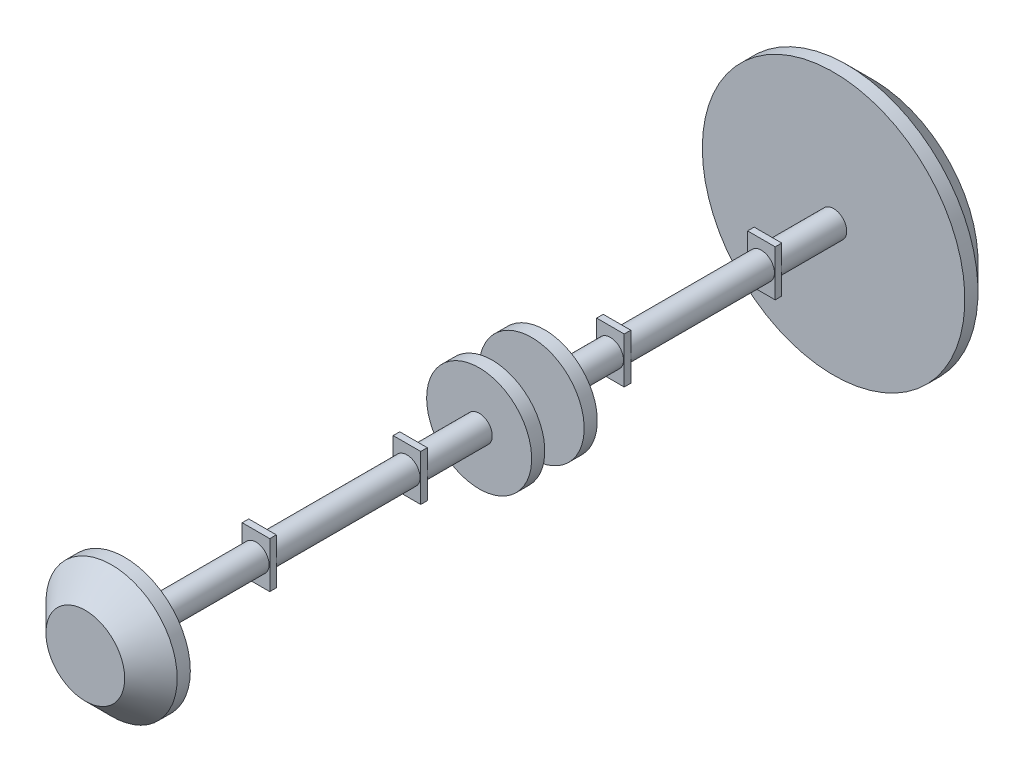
ISO-10303-21;
HEADER;
FILE_DESCRIPTION(('STEP AP214'),'2;1');
FILE_NAME('part.step','',(''),(''),'','','');
FILE_SCHEMA(('AUTOMOTIVE_DESIGN { 1 0 10303 214 1 1 1 1 }'));
ENDSEC;
DATA;
#1=APPLICATION_CONTEXT('core data for automotive mechanical design processes');
#2=APPLICATION_PROTOCOL_DEFINITION('international standard','automotive_design',2000,#1);
#3=PRODUCT_CONTEXT('',#1,'mechanical');
#4=PRODUCT('Part','Part','',(#3));
#5=PRODUCT_RELATED_PRODUCT_CATEGORY('part','',(#4));
#6=PRODUCT_DEFINITION_FORMATION('','',#4);
#7=PRODUCT_DEFINITION_CONTEXT('part definition',#1,'design');
#8=PRODUCT_DEFINITION('design','',#6,#7);
#9=PRODUCT_DEFINITION_SHAPE('','',#8);
#10=(LENGTH_UNIT() NAMED_UNIT(*) SI_UNIT(.MILLI.,.METRE.));
#11=(NAMED_UNIT(*) PLANE_ANGLE_UNIT() SI_UNIT($,.RADIAN.));
#12=(NAMED_UNIT(*) SI_UNIT($,.STERADIAN.) SOLID_ANGLE_UNIT());
#13=UNCERTAINTY_MEASURE_WITH_UNIT(LENGTH_MEASURE(1.E-05),#10,'distance_accuracy_value','');
#14=(GEOMETRIC_REPRESENTATION_CONTEXT(3) GLOBAL_UNCERTAINTY_ASSIGNED_CONTEXT((#13)) GLOBAL_UNIT_ASSIGNED_CONTEXT((#10,
#11,#12)) REPRESENTATION_CONTEXT('',''));
#15=CARTESIAN_POINT('',(0.,0.,0.));
#16=DIRECTION('',(0.,0.,1.));
#17=DIRECTION('',(1.,0.,0.));
#18=AXIS2_PLACEMENT_3D('',#15,#16,#17);
#19=CARTESIAN_POINT('',(0.,0.,-180.));
#20=DIRECTION('',(0.,0.,-1.));
#21=DIRECTION('',(-1.,0.,0.));
#22=AXIS2_PLACEMENT_3D('',#19,#20,#21);
#23=PLANE('',#22);
#24=CARTESIAN_POINT('',(0.,0.,-180.));
#25=DIRECTION('',(0.,0.,-1.));
#26=DIRECTION('',(-1.,0.,0.));
#27=AXIS2_PLACEMENT_3D('',#24,#25,#26);
#28=CIRCLE('',#27,40.);
#29=CARTESIAN_POINT('',(-40.,0.,-180.));
#30=VERTEX_POINT('',#29);
#31=EDGE_CURVE('E136',#30,#30,#28,.T.);
#32=ORIENTED_EDGE('',*,*,#31,.T.);
#33=EDGE_LOOP('',(#32));
#34=FACE_BOUND('',#33,.T.);
#35=ADVANCED_FACE('F42',(#34),#23,.T.);
#36=CARTESIAN_POINT('',(10.5,17.5,-120.));
#37=DIRECTION('',(0.,0.,-1.));
#38=DIRECTION('',(-1.,0.,0.));
#39=AXIS2_PLACEMENT_3D('',#36,#37,#38);
#40=PLANE('',#39);
#41=DIRECTION('',(1.,0.,0.));
#42=VECTOR('',#41,1.);
#43=CARTESIAN_POINT('',(-10.5,17.5,-120.));
#44=LINE('',#43,#42);
#45=CARTESIAN_POINT('',(-10.5,17.5,-120.));
#46=VERTEX_POINT('',#45);
#47=CARTESIAN_POINT('',(10.5,17.5,-120.));
#48=VERTEX_POINT('',#47);
#49=EDGE_CURVE('E118',#46,#48,#44,.T.);
#50=ORIENTED_EDGE('',*,*,#49,.T.);
#51=DIRECTION('',(0.,-1.,0.));
#52=VECTOR('',#51,1.);
#53=CARTESIAN_POINT('',(10.5,17.5,-120.));
#54=LINE('',#53,#52);
#55=CARTESIAN_POINT('',(10.5,-17.5,-120.));
#56=VERTEX_POINT('',#55);
#57=EDGE_CURVE('E111',#48,#56,#54,.T.);
#58=ORIENTED_EDGE('',*,*,#57,.T.);
#59=DIRECTION('',(-1.,0.,0.));
#60=VECTOR('',#59,1.);
#61=CARTESIAN_POINT('',(10.5,-17.5,-120.));
#62=LINE('',#61,#60);
#63=CARTESIAN_POINT('',(-10.5,-17.5,-120.));
#64=VERTEX_POINT('',#63);
#65=EDGE_CURVE('E115',#56,#64,#62,.T.);
#66=ORIENTED_EDGE('',*,*,#65,.T.);
#67=DIRECTION('',(0.,1.,0.));
#68=VECTOR('',#67,1.);
#69=CARTESIAN_POINT('',(-10.5,-17.5,-120.));
#70=LINE('',#69,#68);
#71=EDGE_CURVE('E129',#64,#46,#70,.T.);
#72=ORIENTED_EDGE('',*,*,#71,.T.);
#73=EDGE_LOOP('',(#50,#58,#66,#72));
#74=FACE_BOUND('',#73,.T.);
#75=CARTESIAN_POINT('',(0.,0.,-120.));
#76=DIRECTION('',(0.,0.,-1.));
#77=DIRECTION('',(-1.,0.,0.));
#78=AXIS2_PLACEMENT_3D('',#75,#76,#77);
#79=CIRCLE('',#78,10.);
#80=CARTESIAN_POINT('',(-10.,0.,-120.));
#81=VERTEX_POINT('',#80);
#82=EDGE_CURVE('E149',#81,#81,#79,.T.);
#83=ORIENTED_EDGE('',*,*,#82,.F.);
#84=EDGE_LOOP('',(#83));
#85=FACE_BOUND('',#84,.T.);
#86=ADVANCED_FACE('F112',(#74,#85),#40,.T.);
#87=CARTESIAN_POINT('',(10.5,-17.5,-5.));
#88=DIRECTION('',(0.,0.,-1.));
#89=DIRECTION('',(-1.,0.,0.));
#90=AXIS2_PLACEMENT_3D('',#87,#88,#89);
#91=PLANE('',#90);
#92=DIRECTION('',(0.,-1.,0.));
#93=VECTOR('',#92,1.);
#94=CARTESIAN_POINT('',(10.5,17.5,-5.));
#95=LINE('',#94,#93);
#96=CARTESIAN_POINT('',(10.5,17.5,-5.));
#97=VERTEX_POINT('',#96);
#98=CARTESIAN_POINT('',(10.5,-17.5,-5.));
#99=VERTEX_POINT('',#98);
#100=EDGE_CURVE('E131',#97,#99,#95,.T.);
#101=ORIENTED_EDGE('',*,*,#100,.T.);
#102=DIRECTION('',(-1.,0.,0.));
#103=VECTOR('',#102,1.);
#104=CARTESIAN_POINT('',(10.5,-17.5,-5.));
#105=LINE('',#104,#103);
#106=CARTESIAN_POINT('',(-10.5,-17.5,-5.));
#107=VERTEX_POINT('',#106);
#108=EDGE_CURVE('E244',#99,#107,#105,.T.);
#109=ORIENTED_EDGE('',*,*,#108,.T.);
#110=DIRECTION('',(0.,1.,0.));
#111=VECTOR('',#110,1.);
#112=CARTESIAN_POINT('',(-10.5,17.5,-5.));
#113=LINE('',#112,#111);
#114=CARTESIAN_POINT('',(-10.5,17.5,-5.));
#115=VERTEX_POINT('',#114);
#116=EDGE_CURVE('E241',#107,#115,#113,.T.);
#117=ORIENTED_EDGE('',*,*,#116,.T.);
#118=DIRECTION('',(1.,0.,0.));
#119=VECTOR('',#118,1.);
#120=CARTESIAN_POINT('',(10.5,17.5,-5.));
#121=LINE('',#120,#119);
#122=EDGE_CURVE('E225',#115,#97,#121,.T.);
#123=ORIENTED_EDGE('',*,*,#122,.T.);
#124=EDGE_LOOP('',(#101,#109,#117,#123));
#125=FACE_BOUND('',#124,.T.);
#126=CARTESIAN_POINT('',(0.,0.,-5.));
#127=DIRECTION('',(0.,0.,-1.));
#128=DIRECTION('',(-1.,0.,0.));
#129=AXIS2_PLACEMENT_3D('',#126,#127,#128);
#130=CIRCLE('',#129,10.);
#131=CARTESIAN_POINT('',(-10.,0.,-5.));
#132=VERTEX_POINT('',#131);
#133=EDGE_CURVE('E236',#132,#132,#130,.T.);
#134=ORIENTED_EDGE('',*,*,#133,.F.);
#135=EDGE_LOOP('',(#134));
#136=FACE_BOUND('',#135,.T.);
#137=ADVANCED_FACE('F179',(#125,#136),#91,.T.);
#138=CARTESIAN_POINT('',(0.,0.,100.));
#139=DIRECTION('',(0.,0.,-1.));
#140=DIRECTION('',(-1.,0.,0.));
#141=AXIS2_PLACEMENT_3D('',#138,#139,#140);
#142=CYLINDRICAL_SURFACE('',#141,10.);
#143=CARTESIAN_POINT('',(0.,0.,100.));
#144=DIRECTION('',(0.,0.,1.));
#145=DIRECTION('',(1.,0.,0.));
#146=AXIS2_PLACEMENT_3D('',#143,#144,#145);
#147=CIRCLE('',#146,10.);
#148=CARTESIAN_POINT('',(10.,0.,100.));
#149=VERTEX_POINT('',#148);
#150=EDGE_CURVE('E152',#149,#149,#147,.T.);
#151=ORIENTED_EDGE('',*,*,#150,.F.);
#152=EDGE_LOOP('',(#151));
#153=FACE_BOUND('',#152,.T.);
#154=CARTESIAN_POINT('',(0.,0.,0.));
#155=DIRECTION('',(0.,0.,-1.));
#156=DIRECTION('',(-1.,0.,0.));
#157=AXIS2_PLACEMENT_3D('',#154,#155,#156);
#158=CIRCLE('',#157,10.);
#159=CARTESIAN_POINT('',(-10.,0.,0.));
#160=VERTEX_POINT('',#159);
#161=EDGE_CURVE('E221',#160,#160,#158,.T.);
#162=ORIENTED_EDGE('',*,*,#161,.F.);
#163=EDGE_LOOP('',(#162));
#164=FACE_BOUND('',#163,.T.);
#165=ADVANCED_FACE('F185',(#153,#164),#142,.T.);
#166=CARTESIAN_POINT('',(10.5,-17.5,0.));
#167=DIRECTION('',(0.,0.,-1.));
#168=DIRECTION('',(-1.,0.,0.));
#169=AXIS2_PLACEMENT_3D('',#166,#167,#168);
#170=PLANE('',#169);
#171=DIRECTION('',(0.,-1.,0.));
#172=VECTOR('',#171,1.);
#173=CARTESIAN_POINT('',(10.5,17.5,0.));
#174=LINE('',#173,#172);
#175=CARTESIAN_POINT('',(10.5,17.5,0.));
#176=VERTEX_POINT('',#175);
#177=CARTESIAN_POINT('',(10.5,-17.5,0.));
#178=VERTEX_POINT('',#177);
#179=EDGE_CURVE('E224',#176,#178,#174,.T.);
#180=ORIENTED_EDGE('',*,*,#179,.F.);
#181=DIRECTION('',(1.,0.,0.));
#182=VECTOR('',#181,1.);
#183=CARTESIAN_POINT('',(10.5,17.5,0.));
#184=LINE('',#183,#182);
#185=CARTESIAN_POINT('',(-10.5,17.5,0.));
#186=VERTEX_POINT('',#185);
#187=EDGE_CURVE('E86',#186,#176,#184,.T.);
#188=ORIENTED_EDGE('',*,*,#187,.F.);
#189=DIRECTION('',(0.,1.,0.));
#190=VECTOR('',#189,1.);
#191=CARTESIAN_POINT('',(-10.5,17.5,0.));
#192=LINE('',#191,#190);
#193=CARTESIAN_POINT('',(-10.5,-17.5,0.));
#194=VERTEX_POINT('',#193);
#195=EDGE_CURVE('E229',#194,#186,#192,.T.);
#196=ORIENTED_EDGE('',*,*,#195,.F.);
#197=DIRECTION('',(-1.,0.,0.));
#198=VECTOR('',#197,1.);
#199=CARTESIAN_POINT('',(10.5,-17.5,0.));
#200=LINE('',#199,#198);
#201=EDGE_CURVE('E230',#178,#194,#200,.T.);
#202=ORIENTED_EDGE('',*,*,#201,.F.);
#203=EDGE_LOOP('',(#180,#188,#196,#202));
#204=FACE_BOUND('',#203,.T.);
#205=ORIENTED_EDGE('',*,*,#161,.T.);
#206=EDGE_LOOP('',(#205));
#207=FACE_BOUND('',#206,.T.);
#208=ADVANCED_FACE('F276',(#204,#207),#170,.F.);
#209=CARTESIAN_POINT('',(10.5,17.5,-5.));
#210=DIRECTION('',(-1.,0.,0.));
#211=DIRECTION('',(0.,-1.,0.));
#212=AXIS2_PLACEMENT_3D('',#209,#210,#211);
#213=PLANE('',#212);
#214=ORIENTED_EDGE('',*,*,#179,.T.);
#215=DIRECTION('',(0.,0.,1.));
#216=VECTOR('',#215,1.);
#217=CARTESIAN_POINT('',(10.5,-17.5,-5.));
#218=LINE('',#217,#216);
#219=EDGE_CURVE('E226',#99,#178,#218,.T.);
#220=ORIENTED_EDGE('',*,*,#219,.F.);
#221=ORIENTED_EDGE('',*,*,#100,.F.);
#222=DIRECTION('',(0.,0.,1.));
#223=VECTOR('',#222,1.);
#224=CARTESIAN_POINT('',(10.5,17.5,-5.));
#225=LINE('',#224,#223);
#226=EDGE_CURVE('E237',#97,#176,#225,.T.);
#227=ORIENTED_EDGE('',*,*,#226,.T.);
#228=EDGE_LOOP('',(#214,#220,#221,#227));
#229=FACE_BOUND('',#228,.T.);
#230=ADVANCED_FACE('F278',(#229),#213,.F.);
#231=CARTESIAN_POINT('',(10.5,-17.5,-5.));
#232=DIRECTION('',(0.,1.,0.));
#233=DIRECTION('',(-1.,0.,0.));
#234=AXIS2_PLACEMENT_3D('',#231,#232,#233);
#235=PLANE('',#234);
#236=ORIENTED_EDGE('',*,*,#201,.T.);
#237=DIRECTION('',(0.,0.,1.));
#238=VECTOR('',#237,1.);
#239=CARTESIAN_POINT('',(-10.5,-17.5,-5.));
#240=LINE('',#239,#238);
#241=EDGE_CURVE('E231',#107,#194,#240,.T.);
#242=ORIENTED_EDGE('',*,*,#241,.F.);
#243=ORIENTED_EDGE('',*,*,#108,.F.);
#244=ORIENTED_EDGE('',*,*,#219,.T.);
#245=EDGE_LOOP('',(#236,#242,#243,#244));
#246=FACE_BOUND('',#245,.T.);
#247=ADVANCED_FACE('F286',(#246),#235,.F.);
#248=CARTESIAN_POINT('',(-10.5,17.5,-5.));
#249=DIRECTION('',(1.,0.,0.));
#250=DIRECTION('',(0.,1.,0.));
#251=AXIS2_PLACEMENT_3D('',#248,#249,#250);
#252=PLANE('',#251);
#253=ORIENTED_EDGE('',*,*,#195,.T.);
#254=DIRECTION('',(0.,0.,1.));
#255=VECTOR('',#254,1.);
#256=CARTESIAN_POINT('',(-10.5,17.5,-5.));
#257=LINE('',#256,#255);
#258=EDGE_CURVE('E234',#115,#186,#257,.T.);
#259=ORIENTED_EDGE('',*,*,#258,.F.);
#260=ORIENTED_EDGE('',*,*,#116,.F.);
#261=ORIENTED_EDGE('',*,*,#241,.T.);
#262=EDGE_LOOP('',(#253,#259,#260,#261));
#263=FACE_BOUND('',#262,.T.);
#264=ADVANCED_FACE('F283',(#263),#252,.F.);
#265=CARTESIAN_POINT('',(10.5,17.5,-5.));
#266=DIRECTION('',(0.,-1.,0.));
#267=DIRECTION('',(1.,0.,0.));
#268=AXIS2_PLACEMENT_3D('',#265,#266,#267);
#269=PLANE('',#268);
#270=ORIENTED_EDGE('',*,*,#187,.T.);
#271=ORIENTED_EDGE('',*,*,#226,.F.);
#272=ORIENTED_EDGE('',*,*,#122,.F.);
#273=ORIENTED_EDGE('',*,*,#258,.T.);
#274=EDGE_LOOP('',(#270,#271,#272,#273));
#275=FACE_BOUND('',#274,.T.);
#276=ADVANCED_FACE('F274',(#275),#269,.F.);
#277=CARTESIAN_POINT('',(0.,0.,-115.));
#278=DIRECTION('',(0.,0.,1.));
#279=DIRECTION('',(1.,0.,0.));
#280=AXIS2_PLACEMENT_3D('',#277,#278,#279);
#281=CYLINDRICAL_SURFACE('',#280,10.);
#282=CARTESIAN_POINT('',(0.,0.,-115.));
#283=DIRECTION('',(0.,0.,-1.));
#284=DIRECTION('',(-1.,0.,0.));
#285=AXIS2_PLACEMENT_3D('',#282,#283,#284);
#286=CIRCLE('',#285,10.);
#287=CARTESIAN_POINT('',(-10.,0.,-115.));
#288=VERTEX_POINT('',#287);
#289=EDGE_CURVE('E145',#288,#288,#286,.T.);
#290=ORIENTED_EDGE('',*,*,#289,.F.);
#291=EDGE_LOOP('',(#290));
#292=FACE_BOUND('',#291,.T.);
#293=ORIENTED_EDGE('',*,*,#133,.T.);
#294=EDGE_LOOP('',(#293));
#295=FACE_BOUND('',#294,.T.);
#296=ADVANCED_FACE('F194',(#292,#295),#281,.T.);
#297=CARTESIAN_POINT('',(10.5,17.5,-115.));
#298=DIRECTION('',(0.,0.,-1.));
#299=DIRECTION('',(-1.,0.,0.));
#300=AXIS2_PLACEMENT_3D('',#297,#298,#299);
#301=PLANE('',#300);
#302=DIRECTION('',(1.,0.,0.));
#303=VECTOR('',#302,1.);
#304=CARTESIAN_POINT('',(-10.5,17.5,-115.));
#305=LINE('',#304,#303);
#306=CARTESIAN_POINT('',(-10.5,17.5,-115.));
#307=VERTEX_POINT('',#306);
#308=CARTESIAN_POINT('',(10.5,17.5,-115.));
#309=VERTEX_POINT('',#308);
#310=EDGE_CURVE('E142',#307,#309,#305,.T.);
#311=ORIENTED_EDGE('',*,*,#310,.F.);
#312=DIRECTION('',(0.,1.,0.));
#313=VECTOR('',#312,1.);
#314=CARTESIAN_POINT('',(-10.5,-17.5,-115.));
#315=LINE('',#314,#313);
#316=CARTESIAN_POINT('',(-10.5,-17.5,-115.));
#317=VERTEX_POINT('',#316);
#318=EDGE_CURVE('E59',#317,#307,#315,.T.);
#319=ORIENTED_EDGE('',*,*,#318,.F.);
#320=DIRECTION('',(-1.,0.,0.));
#321=VECTOR('',#320,1.);
#322=CARTESIAN_POINT('',(10.5,-17.5,-115.));
#323=LINE('',#322,#321);
#324=CARTESIAN_POINT('',(10.5,-17.5,-115.));
#325=VERTEX_POINT('',#324);
#326=EDGE_CURVE('E124',#325,#317,#323,.T.);
#327=ORIENTED_EDGE('',*,*,#326,.F.);
#328=DIRECTION('',(0.,-1.,0.));
#329=VECTOR('',#328,1.);
#330=CARTESIAN_POINT('',(10.5,17.5,-115.));
#331=LINE('',#330,#329);
#332=EDGE_CURVE('E72',#309,#325,#331,.T.);
#333=ORIENTED_EDGE('',*,*,#332,.F.);
#334=EDGE_LOOP('',(#311,#319,#327,#333));
#335=FACE_BOUND('',#334,.T.);
#336=ORIENTED_EDGE('',*,*,#289,.T.);
#337=EDGE_LOOP('',(#336));
#338=FACE_BOUND('',#337,.T.);
#339=ADVANCED_FACE('F191',(#335,#338),#301,.F.);
#340=CARTESIAN_POINT('',(-10.5,17.5,-120.));
#341=DIRECTION('',(0.,-1.,0.));
#342=DIRECTION('',(1.,0.,0.));
#343=AXIS2_PLACEMENT_3D('',#340,#341,#342);
#344=PLANE('',#343);
#345=ORIENTED_EDGE('',*,*,#310,.T.);
#346=DIRECTION('',(0.,0.,1.));
#347=VECTOR('',#346,1.);
#348=CARTESIAN_POINT('',(10.5,17.5,-120.));
#349=LINE('',#348,#347);
#350=EDGE_CURVE('E139',#48,#309,#349,.T.);
#351=ORIENTED_EDGE('',*,*,#350,.F.);
#352=ORIENTED_EDGE('',*,*,#49,.F.);
#353=DIRECTION('',(0.,0.,1.));
#354=VECTOR('',#353,1.);
#355=CARTESIAN_POINT('',(-10.5,17.5,-120.));
#356=LINE('',#355,#354);
#357=EDGE_CURVE('E141',#46,#307,#356,.T.);
#358=ORIENTED_EDGE('',*,*,#357,.T.);
#359=EDGE_LOOP('',(#345,#351,#352,#358));
#360=FACE_BOUND('',#359,.T.);
#361=ADVANCED_FACE('F193',(#360),#344,.F.);
#362=CARTESIAN_POINT('',(10.5,17.5,-120.));
#363=DIRECTION('',(-1.,0.,0.));
#364=DIRECTION('',(0.,-1.,0.));
#365=AXIS2_PLACEMENT_3D('',#362,#363,#364);
#366=PLANE('',#365);
#367=ORIENTED_EDGE('',*,*,#332,.T.);
#368=DIRECTION('',(0.,0.,1.));
#369=VECTOR('',#368,1.);
#370=CARTESIAN_POINT('',(10.5,-17.5,-120.));
#371=LINE('',#370,#369);
#372=EDGE_CURVE('E121',#56,#325,#371,.T.);
#373=ORIENTED_EDGE('',*,*,#372,.F.);
#374=ORIENTED_EDGE('',*,*,#57,.F.);
#375=ORIENTED_EDGE('',*,*,#350,.T.);
#376=EDGE_LOOP('',(#367,#373,#374,#375));
#377=FACE_BOUND('',#376,.T.);
#378=ADVANCED_FACE('F122',(#377),#366,.F.);
#379=CARTESIAN_POINT('',(10.5,-17.5,-120.));
#380=DIRECTION('',(0.,1.,0.));
#381=DIRECTION('',(-1.,0.,0.));
#382=AXIS2_PLACEMENT_3D('',#379,#380,#381);
#383=PLANE('',#382);
#384=ORIENTED_EDGE('',*,*,#326,.T.);
#385=DIRECTION('',(0.,0.,1.));
#386=VECTOR('',#385,1.);
#387=CARTESIAN_POINT('',(-10.5,-17.5,-120.));
#388=LINE('',#387,#386);
#389=EDGE_CURVE('E127',#64,#317,#388,.T.);
#390=ORIENTED_EDGE('',*,*,#389,.F.);
#391=ORIENTED_EDGE('',*,*,#65,.F.);
#392=ORIENTED_EDGE('',*,*,#372,.T.);
#393=EDGE_LOOP('',(#384,#390,#391,#392));
#394=FACE_BOUND('',#393,.T.);
#395=ADVANCED_FACE('F126',(#394),#383,.F.);
#396=CARTESIAN_POINT('',(-10.5,-17.5,-120.));
#397=DIRECTION('',(1.,0.,0.));
#398=DIRECTION('',(0.,1.,0.));
#399=AXIS2_PLACEMENT_3D('',#396,#397,#398);
#400=PLANE('',#399);
#401=ORIENTED_EDGE('',*,*,#318,.T.);
#402=ORIENTED_EDGE('',*,*,#357,.F.);
#403=ORIENTED_EDGE('',*,*,#71,.F.);
#404=ORIENTED_EDGE('',*,*,#389,.T.);
#405=EDGE_LOOP('',(#401,#402,#403,#404));
#406=FACE_BOUND('',#405,.T.);
#407=ADVANCED_FACE('F175',(#406),#400,.F.);
#408=CARTESIAN_POINT('',(0.,0.,-170.));
#409=DIRECTION('',(0.,0.,1.));
#410=DIRECTION('',(1.,0.,0.));
#411=AXIS2_PLACEMENT_3D('',#408,#409,#410);
#412=CYLINDRICAL_SURFACE('',#411,10.);
#413=CARTESIAN_POINT('',(0.,0.,-170.));
#414=DIRECTION('',(0.,0.,-1.));
#415=DIRECTION('',(-1.,0.,0.));
#416=AXIS2_PLACEMENT_3D('',#413,#414,#415);
#417=CIRCLE('',#416,10.);
#418=CARTESIAN_POINT('',(-10.,0.,-170.));
#419=VERTEX_POINT('',#418);
#420=EDGE_CURVE('E51',#419,#419,#417,.T.);
#421=ORIENTED_EDGE('',*,*,#420,.F.);
#422=EDGE_LOOP('',(#421));
#423=FACE_BOUND('',#422,.T.);
#424=ORIENTED_EDGE('',*,*,#82,.T.);
#425=EDGE_LOOP('',(#424));
#426=FACE_BOUND('',#425,.T.);
#427=ADVANCED_FACE('F171',(#423,#426),#412,.T.);
#428=CARTESIAN_POINT('',(0.,0.,100.));
#429=DIRECTION('',(0.,0.,1.));
#430=DIRECTION('',(1.,0.,0.));
#431=AXIS2_PLACEMENT_3D('',#428,#429,#430);
#432=PLANE('',#431);
#433=CARTESIAN_POINT('',(0.,0.,100.));
#434=DIRECTION('',(0.,0.,1.));
#435=DIRECTION('',(1.,0.,0.));
#436=AXIS2_PLACEMENT_3D('',#433,#434,#435);
#437=CIRCLE('',#436,50.);
#438=CARTESIAN_POINT('',(50.,0.,100.));
#439=VERTEX_POINT('',#438);
#440=EDGE_CURVE('E153',#439,#439,#437,.T.);
#441=ORIENTED_EDGE('',*,*,#440,.F.);
#442=EDGE_LOOP('',(#441));
#443=FACE_BOUND('',#442,.T.);
#444=ORIENTED_EDGE('',*,*,#150,.T.);
#445=EDGE_LOOP('',(#444));
#446=FACE_BOUND('',#445,.T.);
#447=ADVANCED_FACE('F174',(#443,#446),#432,.F.);
#448=CARTESIAN_POINT('',(0.,0.,130.));
#449=DIRECTION('',(0.,0.,-1.));
#450=DIRECTION('',(-1.,0.,0.));
#451=AXIS2_PLACEMENT_3D('',#448,#449,#450);
#452=CYLINDRICAL_SURFACE('',#451,50.);
#453=CARTESIAN_POINT('',(0.,0.,110.));
#454=DIRECTION('',(0.,0.,1.));
#455=DIRECTION('',(1.,0.,0.));
#456=AXIS2_PLACEMENT_3D('',#453,#454,#455);
#457=CIRCLE('',#456,50.);
#458=CARTESIAN_POINT('',(50.,0.,110.));
#459=VERTEX_POINT('',#458);
#460=EDGE_CURVE('E155',#459,#459,#457,.F.);
#461=ORIENTED_EDGE('',*,*,#460,.T.);
#462=EDGE_LOOP('',(#461));
#463=FACE_BOUND('',#462,.T.);
#464=ORIENTED_EDGE('',*,*,#440,.T.);
#465=EDGE_LOOP('',(#464));
#466=FACE_BOUND('',#465,.T.);
#467=ADVANCED_FACE('F196',(#463,#466),#452,.T.);
#468=CARTESIAN_POINT('',(0.,0.,130.));
#469=DIRECTION('',(0.,0.,1.));
#470=DIRECTION('',(1.,0.,0.));
#471=AXIS2_PLACEMENT_3D('',#468,#469,#470);
#472=PLANE('',#471);
#473=CARTESIAN_POINT('',(0.,0.,130.));
#474=DIRECTION('',(0.,0.,1.));
#475=DIRECTION('',(1.,0.,0.));
#476=AXIS2_PLACEMENT_3D('',#473,#474,#475);
#477=CIRCLE('',#476,30.);
#478=CARTESIAN_POINT('',(30.,0.,130.));
#479=VERTEX_POINT('',#478);
#480=EDGE_CURVE('E148',#479,#479,#477,.T.);
#481=ORIENTED_EDGE('',*,*,#480,.T.);
#482=EDGE_LOOP('',(#481));
#483=FACE_BOUND('',#482,.T.);
#484=ADVANCED_FACE('F199',(#483),#472,.T.);
#485=CARTESIAN_POINT('',(0.,0.,130.));
#486=DIRECTION('',(0.,0.,-1.));
#487=DIRECTION('',(-1.,0.,0.));
#488=AXIS2_PLACEMENT_3D('',#485,#486,#487);
#489=CONICAL_SURFACE('',#488,30.,0.785398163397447);
#490=ORIENTED_EDGE('',*,*,#460,.F.);
#491=EDGE_LOOP('',(#490));
#492=FACE_BOUND('',#491,.T.);
#493=ORIENTED_EDGE('',*,*,#480,.F.);
#494=EDGE_LOOP('',(#493));
#495=FACE_BOUND('',#494,.T.);
#496=ADVANCED_FACE('F168',(#492,#495),#489,.T.);
#497=CARTESIAN_POINT('',(0.,0.,-170.));
#498=DIRECTION('',(0.,0.,-1.));
#499=DIRECTION('',(-1.,0.,0.));
#500=AXIS2_PLACEMENT_3D('',#497,#498,#499);
#501=PLANE('',#500);
#502=CARTESIAN_POINT('',(0.,0.,-170.));
#503=DIRECTION('',(0.,0.,-1.));
#504=DIRECTION('',(-1.,0.,0.));
#505=AXIS2_PLACEMENT_3D('',#502,#503,#504);
#506=CIRCLE('',#505,40.);
#507=CARTESIAN_POINT('',(-40.,0.,-170.));
#508=VERTEX_POINT('',#507);
#509=EDGE_CURVE('E12',#508,#508,#506,.T.);
#510=ORIENTED_EDGE('',*,*,#509,.F.);
#511=EDGE_LOOP('',(#510));
#512=FACE_BOUND('',#511,.T.);
#513=ORIENTED_EDGE('',*,*,#420,.T.);
#514=EDGE_LOOP('',(#513));
#515=FACE_BOUND('',#514,.T.);
#516=ADVANCED_FACE('F44',(#512,#515),#501,.F.);
#517=CARTESIAN_POINT('',(0.,0.,-180.));
#518=DIRECTION('',(0.,0.,1.));
#519=DIRECTION('',(1.,0.,0.));
#520=AXIS2_PLACEMENT_3D('',#517,#518,#519);
#521=CYLINDRICAL_SURFACE('',#520,40.);
#522=ORIENTED_EDGE('',*,*,#31,.F.);
#523=EDGE_LOOP('',(#522));
#524=FACE_BOUND('',#523,.T.);
#525=ORIENTED_EDGE('',*,*,#509,.T.);
#526=EDGE_LOOP('',(#525));
#527=FACE_BOUND('',#526,.T.);
#528=ADVANCED_FACE('F160',(#524,#527),#521,.T.);
#529=CLOSED_SHELL('',(#35,#86,#137,#165,#208,#230,#247,#264,#276,#296,#339,#361,#378,#395,#407,
#427,#447,#467,#484,#496,#516,#528));
#530=MANIFOLD_SOLID_BREP('B2',#529);
#531=CARTESIAN_POINT('',(-10.5,-17.5,-390.));
#532=DIRECTION('',(0.,0.,-1.));
#533=DIRECTION('',(-1.,0.,0.));
#534=AXIS2_PLACEMENT_3D('',#531,#532,#533);
#535=PLANE('',#534);
#536=DIRECTION('',(-1.,0.,0.));
#537=VECTOR('',#536,1.);
#538=CARTESIAN_POINT('',(10.5,-17.5,-390.));
#539=LINE('',#538,#537);
#540=CARTESIAN_POINT('',(10.5,-17.5,-390.));
#541=VERTEX_POINT('',#540);
#542=CARTESIAN_POINT('',(-10.5,-17.5,-390.));
#543=VERTEX_POINT('',#542);
#544=EDGE_CURVE('E549',#541,#543,#539,.T.);
#545=ORIENTED_EDGE('',*,*,#544,.T.);
#546=DIRECTION('',(0.,1.,0.));
#547=VECTOR('',#546,1.);
#548=CARTESIAN_POINT('',(-10.5,-17.5,-390.));
#549=LINE('',#548,#547);
#550=CARTESIAN_POINT('',(-10.5,17.5,-390.));
#551=VERTEX_POINT('',#550);
#552=EDGE_CURVE('E528',#543,#551,#549,.T.);
#553=ORIENTED_EDGE('',*,*,#552,.T.);
#554=DIRECTION('',(1.,0.,0.));
#555=VECTOR('',#554,1.);
#556=CARTESIAN_POINT('',(-10.5,17.5,-390.));
#557=LINE('',#556,#555);
#558=CARTESIAN_POINT('',(10.5,17.5,-390.));
#559=VERTEX_POINT('',#558);
#560=EDGE_CURVE('E552',#551,#559,#557,.T.);
#561=ORIENTED_EDGE('',*,*,#560,.T.);
#562=DIRECTION('',(0.,-1.,0.));
#563=VECTOR('',#562,1.);
#564=CARTESIAN_POINT('',(10.5,17.5,-390.));
#565=LINE('',#564,#563);
#566=EDGE_CURVE('E554',#559,#541,#565,.T.);
#567=ORIENTED_EDGE('',*,*,#566,.T.);
#568=EDGE_LOOP('',(#545,#553,#561,#567));
#569=FACE_BOUND('',#568,.T.);
#570=CARTESIAN_POINT('',(0.,0.,-390.));
#571=DIRECTION('',(0.,0.,-1.));
#572=DIRECTION('',(-1.,0.,0.));
#573=AXIS2_PLACEMENT_3D('',#570,#571,#572);
#574=CIRCLE('',#573,10.);
#575=CARTESIAN_POINT('',(-10.,0.,-390.));
#576=VERTEX_POINT('',#575);
#577=EDGE_CURVE('E542',#576,#576,#574,.T.);
#578=ORIENTED_EDGE('',*,*,#577,.F.);
#579=EDGE_LOOP('',(#578));
#580=FACE_BOUND('',#579,.T.);
#581=ADVANCED_FACE('F448',(#569,#580),#535,.T.);
#582=CARTESIAN_POINT('',(-10.5,-17.5,-275.));
#583=DIRECTION('',(0.,0.,1.));
#584=DIRECTION('',(1.,0.,0.));
#585=AXIS2_PLACEMENT_3D('',#582,#583,#584);
#586=PLANE('',#585);
#587=DIRECTION('',(0.,1.,0.));
#588=VECTOR('',#587,1.);
#589=CARTESIAN_POINT('',(-10.5,-17.5,-275.));
#590=LINE('',#589,#588);
#591=CARTESIAN_POINT('',(-10.5,-17.5,-275.));
#592=VERTEX_POINT('',#591);
#593=CARTESIAN_POINT('',(-10.5,17.5,-275.));
#594=VERTEX_POINT('',#593);
#595=EDGE_CURVE('E572',#592,#594,#590,.T.);
#596=ORIENTED_EDGE('',*,*,#595,.T.);
#597=DIRECTION('',(1.,0.,0.));
#598=VECTOR('',#597,1.);
#599=CARTESIAN_POINT('',(-10.5,17.5,-275.));
#600=LINE('',#599,#598);
#601=CARTESIAN_POINT('',(10.5,17.5,-275.));
#602=VERTEX_POINT('',#601);
#603=EDGE_CURVE('E574',#594,#602,#600,.T.);
#604=ORIENTED_EDGE('',*,*,#603,.T.);
#605=DIRECTION('',(0.,-1.,0.));
#606=VECTOR('',#605,1.);
#607=CARTESIAN_POINT('',(10.5,17.5,-275.));
#608=LINE('',#607,#606);
#609=CARTESIAN_POINT('',(10.5,-17.5,-275.));
#610=VERTEX_POINT('',#609);
#611=EDGE_CURVE('E468',#602,#610,#608,.T.);
#612=ORIENTED_EDGE('',*,*,#611,.T.);
#613=DIRECTION('',(-1.,0.,0.));
#614=VECTOR('',#613,1.);
#615=CARTESIAN_POINT('',(10.5,-17.5,-275.));
#616=LINE('',#615,#614);
#617=EDGE_CURVE('E463',#610,#592,#616,.T.);
#618=ORIENTED_EDGE('',*,*,#617,.T.);
#619=EDGE_LOOP('',(#596,#604,#612,#618));
#620=FACE_BOUND('',#619,.T.);
#621=CARTESIAN_POINT('',(0.,0.,-275.));
#622=DIRECTION('',(0.,0.,1.));
#623=DIRECTION('',(1.,0.,0.));
#624=AXIS2_PLACEMENT_3D('',#621,#622,#623);
#625=CIRCLE('',#624,10.);
#626=CARTESIAN_POINT('',(10.,0.,-275.));
#627=VERTEX_POINT('',#626);
#628=EDGE_CURVE('E602',#627,#627,#625,.F.);
#629=ORIENTED_EDGE('',*,*,#628,.F.);
#630=EDGE_LOOP('',(#629));
#631=FACE_BOUND('',#630,.T.);
#632=ADVANCED_FACE('F621',(#620,#631),#586,.F.);
#633=CARTESIAN_POINT('',(0.,0.,-270.));
#634=DIRECTION('',(0.,0.,1.));
#635=DIRECTION('',(1.,0.,0.));
#636=AXIS2_PLACEMENT_3D('',#633,#634,#635);
#637=CYLINDRICAL_SURFACE('',#636,10.);
#638=CARTESIAN_POINT('',(0.,0.,-270.));
#639=DIRECTION('',(0.,0.,-1.));
#640=DIRECTION('',(-1.,0.,0.));
#641=AXIS2_PLACEMENT_3D('',#638,#639,#640);
#642=CIRCLE('',#641,10.);
#643=CARTESIAN_POINT('',(-10.,0.,-270.));
#644=VERTEX_POINT('',#643);
#645=EDGE_CURVE('E593',#644,#644,#642,.T.);
#646=ORIENTED_EDGE('',*,*,#645,.F.);
#647=EDGE_LOOP('',(#646));
#648=FACE_BOUND('',#647,.T.);
#649=CARTESIAN_POINT('',(0.,0.,-220.));
#650=DIRECTION('',(0.,0.,-1.));
#651=DIRECTION('',(-1.,0.,0.));
#652=AXIS2_PLACEMENT_3D('',#649,#650,#651);
#653=CIRCLE('',#652,10.);
#654=CARTESIAN_POINT('',(-10.,0.,-220.));
#655=VERTEX_POINT('',#654);
#656=EDGE_CURVE('E590',#655,#655,#653,.T.);
#657=ORIENTED_EDGE('',*,*,#656,.T.);
#658=EDGE_LOOP('',(#657));
#659=FACE_BOUND('',#658,.T.);
#660=ADVANCED_FACE('F627',(#648,#659),#637,.T.);
#661=CARTESIAN_POINT('',(0.,0.,-220.));
#662=DIRECTION('',(0.,0.,-1.));
#663=DIRECTION('',(-1.,0.,0.));
#664=AXIS2_PLACEMENT_3D('',#661,#662,#663);
#665=PLANE('',#664);
#666=CARTESIAN_POINT('',(0.,0.,-220.));
#667=DIRECTION('',(0.,0.,-1.));
#668=DIRECTION('',(-1.,0.,0.));
#669=AXIS2_PLACEMENT_3D('',#666,#667,#668);
#670=CIRCLE('',#669,40.);
#671=CARTESIAN_POINT('',(-40.,0.,-220.));
#672=VERTEX_POINT('',#671);
#673=EDGE_CURVE('E599',#672,#672,#670,.T.);
#674=ORIENTED_EDGE('',*,*,#673,.T.);
#675=EDGE_LOOP('',(#674));
#676=FACE_BOUND('',#675,.T.);
#677=ORIENTED_EDGE('',*,*,#656,.F.);
#678=EDGE_LOOP('',(#677));
#679=FACE_BOUND('',#678,.T.);
#680=ADVANCED_FACE('F673',(#676,#679),#665,.T.);
#681=CARTESIAN_POINT('',(0.,0.,-220.));
#682=DIRECTION('',(0.,0.,1.));
#683=DIRECTION('',(1.,0.,0.));
#684=AXIS2_PLACEMENT_3D('',#681,#682,#683);
#685=CYLINDRICAL_SURFACE('',#684,40.);
#686=ORIENTED_EDGE('',*,*,#673,.F.);
#687=EDGE_LOOP('',(#686));
#688=FACE_BOUND('',#687,.T.);
#689=CARTESIAN_POINT('',(0.,0.,-210.));
#690=DIRECTION('',(0.,0.,-1.));
#691=DIRECTION('',(-1.,0.,0.));
#692=AXIS2_PLACEMENT_3D('',#689,#690,#691);
#693=CIRCLE('',#692,40.);
#694=CARTESIAN_POINT('',(-40.,0.,-210.));
#695=VERTEX_POINT('',#694);
#696=EDGE_CURVE('E596',#695,#695,#693,.T.);
#697=ORIENTED_EDGE('',*,*,#696,.T.);
#698=EDGE_LOOP('',(#697));
#699=FACE_BOUND('',#698,.T.);
#700=ADVANCED_FACE('F450',(#688,#699),#685,.T.);
#701=CARTESIAN_POINT('',(0.,0.,-210.));
#702=DIRECTION('',(0.,0.,-1.));
#703=DIRECTION('',(-1.,0.,0.));
#704=AXIS2_PLACEMENT_3D('',#701,#702,#703);
#705=PLANE('',#704);
#706=ORIENTED_EDGE('',*,*,#696,.F.);
#707=EDGE_LOOP('',(#706));
#708=FACE_BOUND('',#707,.T.);
#709=ADVANCED_FACE('F654',(#708),#705,.F.);
#710=CARTESIAN_POINT('',(-10.5,-17.5,-270.));
#711=DIRECTION('',(0.,0.,1.));
#712=DIRECTION('',(1.,0.,0.));
#713=AXIS2_PLACEMENT_3D('',#710,#711,#712);
#714=PLANE('',#713);
#715=DIRECTION('',(0.,1.,0.));
#716=VECTOR('',#715,1.);
#717=CARTESIAN_POINT('',(-10.5,-17.5,-270.));
#718=LINE('',#717,#716);
#719=CARTESIAN_POINT('',(-10.5,-17.5,-270.));
#720=VERTEX_POINT('',#719);
#721=CARTESIAN_POINT('',(-10.5,17.5,-270.));
#722=VERTEX_POINT('',#721);
#723=EDGE_CURVE('E563',#720,#722,#718,.T.);
#724=ORIENTED_EDGE('',*,*,#723,.F.);
#725=DIRECTION('',(-1.,0.,0.));
#726=VECTOR('',#725,1.);
#727=CARTESIAN_POINT('',(10.5,-17.5,-270.));
#728=LINE('',#727,#726);
#729=CARTESIAN_POINT('',(10.5,-17.5,-270.));
#730=VERTEX_POINT('',#729);
#731=EDGE_CURVE('E570',#730,#720,#728,.T.);
#732=ORIENTED_EDGE('',*,*,#731,.F.);
#733=DIRECTION('',(0.,-1.,0.));
#734=VECTOR('',#733,1.);
#735=CARTESIAN_POINT('',(10.5,17.5,-270.));
#736=LINE('',#735,#734);
#737=CARTESIAN_POINT('',(10.5,17.5,-270.));
#738=VERTEX_POINT('',#737);
#739=EDGE_CURVE('E568',#738,#730,#736,.T.);
#740=ORIENTED_EDGE('',*,*,#739,.F.);
#741=DIRECTION('',(1.,0.,0.));
#742=VECTOR('',#741,1.);
#743=CARTESIAN_POINT('',(-10.5,17.5,-270.));
#744=LINE('',#743,#742);
#745=EDGE_CURVE('E566',#722,#738,#744,.T.);
#746=ORIENTED_EDGE('',*,*,#745,.F.);
#747=EDGE_LOOP('',(#724,#732,#740,#746));
#748=FACE_BOUND('',#747,.T.);
#749=ORIENTED_EDGE('',*,*,#645,.T.);
#750=EDGE_LOOP('',(#749));
#751=FACE_BOUND('',#750,.T.);
#752=ADVANCED_FACE('F651',(#748,#751),#714,.T.);
#753=CARTESIAN_POINT('',(-10.5,-17.5,-275.));
#754=DIRECTION('',(1.,0.,0.));
#755=DIRECTION('',(0.,1.,0.));
#756=AXIS2_PLACEMENT_3D('',#753,#754,#755);
#757=PLANE('',#756);
#758=ORIENTED_EDGE('',*,*,#723,.T.);
#759=DIRECTION('',(0.,0.,1.));
#760=VECTOR('',#759,1.);
#761=CARTESIAN_POINT('',(-10.5,17.5,-275.));
#762=LINE('',#761,#760);
#763=EDGE_CURVE('E587',#594,#722,#762,.T.);
#764=ORIENTED_EDGE('',*,*,#763,.F.);
#765=ORIENTED_EDGE('',*,*,#595,.F.);
#766=DIRECTION('',(0.,0.,1.));
#767=VECTOR('',#766,1.);
#768=CARTESIAN_POINT('',(-10.5,-17.5,-275.));
#769=LINE('',#768,#767);
#770=EDGE_CURVE('E578',#592,#720,#769,.T.);
#771=ORIENTED_EDGE('',*,*,#770,.T.);
#772=EDGE_LOOP('',(#758,#764,#765,#771));
#773=FACE_BOUND('',#772,.T.);
#774=ADVANCED_FACE('F653',(#773),#757,.F.);
#775=CARTESIAN_POINT('',(-10.5,17.5,-275.));
#776=DIRECTION('',(0.,-1.,0.));
#777=DIRECTION('',(1.,0.,0.));
#778=AXIS2_PLACEMENT_3D('',#775,#776,#777);
#779=PLANE('',#778);
#780=ORIENTED_EDGE('',*,*,#745,.T.);
#781=DIRECTION('',(0.,0.,1.));
#782=VECTOR('',#781,1.);
#783=CARTESIAN_POINT('',(10.5,17.5,-275.));
#784=LINE('',#783,#782);
#785=EDGE_CURVE('E584',#602,#738,#784,.T.);
#786=ORIENTED_EDGE('',*,*,#785,.F.);
#787=ORIENTED_EDGE('',*,*,#603,.F.);
#788=ORIENTED_EDGE('',*,*,#763,.T.);
#789=EDGE_LOOP('',(#780,#786,#787,#788));
#790=FACE_BOUND('',#789,.T.);
#791=ADVANCED_FACE('F663',(#790),#779,.F.);
#792=CARTESIAN_POINT('',(10.5,17.5,-275.));
#793=DIRECTION('',(-1.,0.,0.));
#794=DIRECTION('',(0.,-1.,0.));
#795=AXIS2_PLACEMENT_3D('',#792,#793,#794);
#796=PLANE('',#795);
#797=ORIENTED_EDGE('',*,*,#739,.T.);
#798=DIRECTION('',(0.,0.,1.));
#799=VECTOR('',#798,1.);
#800=CARTESIAN_POINT('',(10.5,-17.5,-275.));
#801=LINE('',#800,#799);
#802=EDGE_CURVE('E581',#610,#730,#801,.T.);
#803=ORIENTED_EDGE('',*,*,#802,.F.);
#804=ORIENTED_EDGE('',*,*,#611,.F.);
#805=ORIENTED_EDGE('',*,*,#785,.T.);
#806=EDGE_LOOP('',(#797,#803,#804,#805));
#807=FACE_BOUND('',#806,.T.);
#808=ADVANCED_FACE('F659',(#807),#796,.F.);
#809=CARTESIAN_POINT('',(10.5,-17.5,-275.));
#810=DIRECTION('',(0.,1.,0.));
#811=DIRECTION('',(-1.,0.,0.));
#812=AXIS2_PLACEMENT_3D('',#809,#810,#811);
#813=PLANE('',#812);
#814=ORIENTED_EDGE('',*,*,#731,.T.);
#815=ORIENTED_EDGE('',*,*,#770,.F.);
#816=ORIENTED_EDGE('',*,*,#617,.F.);
#817=ORIENTED_EDGE('',*,*,#802,.T.);
#818=EDGE_LOOP('',(#814,#815,#816,#817));
#819=FACE_BOUND('',#818,.T.);
#820=ADVANCED_FACE('F649',(#819),#813,.F.);
#821=CARTESIAN_POINT('',(0.,0.,-385.));
#822=DIRECTION('',(0.,0.,1.));
#823=DIRECTION('',(1.,0.,0.));
#824=AXIS2_PLACEMENT_3D('',#821,#822,#823);
#825=CYLINDRICAL_SURFACE('',#824,10.);
#826=CARTESIAN_POINT('',(0.,0.,-385.));
#827=DIRECTION('',(0.,0.,-1.));
#828=DIRECTION('',(-1.,0.,0.));
#829=AXIS2_PLACEMENT_3D('',#826,#827,#828);
#830=CIRCLE('',#829,10.);
#831=CARTESIAN_POINT('',(-10.,0.,-385.));
#832=VERTEX_POINT('',#831);
#833=EDGE_CURVE('E532',#832,#832,#830,.T.);
#834=ORIENTED_EDGE('',*,*,#833,.F.);
#835=EDGE_LOOP('',(#834));
#836=FACE_BOUND('',#835,.T.);
#837=ORIENTED_EDGE('',*,*,#628,.T.);
#838=EDGE_LOOP('',(#837));
#839=FACE_BOUND('',#838,.T.);
#840=ADVANCED_FACE('F646',(#836,#839),#825,.T.);
#841=CARTESIAN_POINT('',(-10.5,-17.5,-385.));
#842=DIRECTION('',(0.,0.,-1.));
#843=DIRECTION('',(-1.,0.,0.));
#844=AXIS2_PLACEMENT_3D('',#841,#842,#843);
#845=PLANE('',#844);
#846=DIRECTION('',(-1.,0.,0.));
#847=VECTOR('',#846,1.);
#848=CARTESIAN_POINT('',(10.5,-17.5,-385.));
#849=LINE('',#848,#847);
#850=CARTESIAN_POINT('',(10.5,-17.5,-385.));
#851=VERTEX_POINT('',#850);
#852=CARTESIAN_POINT('',(-10.5,-17.5,-385.));
#853=VERTEX_POINT('',#852);
#854=EDGE_CURVE('E519',#851,#853,#849,.T.);
#855=ORIENTED_EDGE('',*,*,#854,.F.);
#856=DIRECTION('',(0.,-1.,0.));
#857=VECTOR('',#856,1.);
#858=CARTESIAN_POINT('',(10.5,17.5,-385.));
#859=LINE('',#858,#857);
#860=CARTESIAN_POINT('',(10.5,17.5,-385.));
#861=VERTEX_POINT('',#860);
#862=EDGE_CURVE('E547',#861,#851,#859,.T.);
#863=ORIENTED_EDGE('',*,*,#862,.F.);
#864=DIRECTION('',(1.,0.,0.));
#865=VECTOR('',#864,1.);
#866=CARTESIAN_POINT('',(-10.5,17.5,-385.));
#867=LINE('',#866,#865);
#868=CARTESIAN_POINT('',(-10.5,17.5,-385.));
#869=VERTEX_POINT('',#868);
#870=EDGE_CURVE('E520',#869,#861,#867,.T.);
#871=ORIENTED_EDGE('',*,*,#870,.F.);
#872=DIRECTION('',(0.,1.,0.));
#873=VECTOR('',#872,1.);
#874=CARTESIAN_POINT('',(-10.5,-17.5,-385.));
#875=LINE('',#874,#873);
#876=EDGE_CURVE('E513',#853,#869,#875,.T.);
#877=ORIENTED_EDGE('',*,*,#876,.F.);
#878=EDGE_LOOP('',(#855,#863,#871,#877));
#879=FACE_BOUND('',#878,.T.);
#880=ORIENTED_EDGE('',*,*,#833,.T.);
#881=EDGE_LOOP('',(#880));
#882=FACE_BOUND('',#881,.T.);
#883=ADVANCED_FACE('F515',(#879,#882),#845,.F.);
#884=CARTESIAN_POINT('',(10.5,-17.5,-390.));
#885=DIRECTION('',(0.,1.,0.));
#886=DIRECTION('',(-1.,0.,0.));
#887=AXIS2_PLACEMENT_3D('',#884,#885,#886);
#888=PLANE('',#887);
#889=ORIENTED_EDGE('',*,*,#854,.T.);
#890=DIRECTION('',(0.,0.,1.));
#891=VECTOR('',#890,1.);
#892=CARTESIAN_POINT('',(-10.5,-17.5,-390.));
#893=LINE('',#892,#891);
#894=EDGE_CURVE('E526',#543,#853,#893,.T.);
#895=ORIENTED_EDGE('',*,*,#894,.F.);
#896=ORIENTED_EDGE('',*,*,#544,.F.);
#897=DIRECTION('',(0.,0.,1.));
#898=VECTOR('',#897,1.);
#899=CARTESIAN_POINT('',(10.5,-17.5,-390.));
#900=LINE('',#899,#898);
#901=EDGE_CURVE('E538',#541,#851,#900,.T.);
#902=ORIENTED_EDGE('',*,*,#901,.T.);
#903=EDGE_LOOP('',(#889,#895,#896,#902));
#904=FACE_BOUND('',#903,.T.);
#905=ADVANCED_FACE('F536',(#904),#888,.F.);
#906=CARTESIAN_POINT('',(-10.5,-17.5,-390.));
#907=DIRECTION('',(1.,0.,0.));
#908=DIRECTION('',(0.,1.,0.));
#909=AXIS2_PLACEMENT_3D('',#906,#907,#908);
#910=PLANE('',#909);
#911=ORIENTED_EDGE('',*,*,#876,.T.);
#912=DIRECTION('',(0.,0.,1.));
#913=VECTOR('',#912,1.);
#914=CARTESIAN_POINT('',(-10.5,17.5,-390.));
#915=LINE('',#914,#913);
#916=EDGE_CURVE('E533',#551,#869,#915,.T.);
#917=ORIENTED_EDGE('',*,*,#916,.F.);
#918=ORIENTED_EDGE('',*,*,#552,.F.);
#919=ORIENTED_EDGE('',*,*,#894,.T.);
#920=EDGE_LOOP('',(#911,#917,#918,#919));
#921=FACE_BOUND('',#920,.T.);
#922=ADVANCED_FACE('F527',(#921),#910,.F.);
#923=CARTESIAN_POINT('',(-10.5,17.5,-390.));
#924=DIRECTION('',(0.,-1.,0.));
#925=DIRECTION('',(1.,0.,0.));
#926=AXIS2_PLACEMENT_3D('',#923,#924,#925);
#927=PLANE('',#926);
#928=ORIENTED_EDGE('',*,*,#870,.T.);
#929=DIRECTION('',(0.,0.,1.));
#930=VECTOR('',#929,1.);
#931=CARTESIAN_POINT('',(10.5,17.5,-390.));
#932=LINE('',#931,#930);
#933=EDGE_CURVE('E557',#559,#861,#932,.T.);
#934=ORIENTED_EDGE('',*,*,#933,.F.);
#935=ORIENTED_EDGE('',*,*,#560,.F.);
#936=ORIENTED_EDGE('',*,*,#916,.T.);
#937=EDGE_LOOP('',(#928,#934,#935,#936));
#938=FACE_BOUND('',#937,.T.);
#939=ADVANCED_FACE('F637',(#938),#927,.F.);
#940=CARTESIAN_POINT('',(10.5,17.5,-390.));
#941=DIRECTION('',(-1.,0.,0.));
#942=DIRECTION('',(0.,-1.,0.));
#943=AXIS2_PLACEMENT_3D('',#940,#941,#942);
#944=PLANE('',#943);
#945=ORIENTED_EDGE('',*,*,#862,.T.);
#946=ORIENTED_EDGE('',*,*,#901,.F.);
#947=ORIENTED_EDGE('',*,*,#566,.F.);
#948=ORIENTED_EDGE('',*,*,#933,.T.);
#949=EDGE_LOOP('',(#945,#946,#947,#948));
#950=FACE_BOUND('',#949,.T.);
#951=ADVANCED_FACE('F633',(#950),#944,.F.);
#952=CARTESIAN_POINT('',(0.,0.,-440.));
#953=DIRECTION('',(0.,0.,1.));
#954=DIRECTION('',(1.,0.,0.));
#955=AXIS2_PLACEMENT_3D('',#952,#953,#954);
#956=CYLINDRICAL_SURFACE('',#955,10.);
#957=CARTESIAN_POINT('',(0.,0.,-440.));
#958=DIRECTION('',(0.,0.,-1.));
#959=DIRECTION('',(-1.,0.,0.));
#960=AXIS2_PLACEMENT_3D('',#957,#958,#959);
#961=CIRCLE('',#960,10.);
#962=CARTESIAN_POINT('',(-10.,0.,-440.));
#963=VERTEX_POINT('',#962);
#964=EDGE_CURVE('E539',#963,#963,#961,.T.);
#965=ORIENTED_EDGE('',*,*,#964,.F.);
#966=EDGE_LOOP('',(#965));
#967=FACE_BOUND('',#966,.T.);
#968=ORIENTED_EDGE('',*,*,#577,.T.);
#969=EDGE_LOOP('',(#968));
#970=FACE_BOUND('',#969,.T.);
#971=ADVANCED_FACE('F636',(#967,#970),#956,.T.);
#972=CARTESIAN_POINT('',(0.,0.,-440.));
#973=DIRECTION('',(0.,0.,-1.));
#974=DIRECTION('',(-1.,0.,0.));
#975=AXIS2_PLACEMENT_3D('',#972,#973,#974);
#976=PLANE('',#975);
#977=CARTESIAN_POINT('',(0.,0.,-440.));
#978=DIRECTION('',(0.,0.,-1.));
#979=DIRECTION('',(-1.,0.,0.));
#980=AXIS2_PLACEMENT_3D('',#977,#978,#979);
#981=CIRCLE('',#980,100.);
#982=CARTESIAN_POINT('',(-100.,0.,-440.));
#983=VERTEX_POINT('',#982);
#984=EDGE_CURVE('E830',#983,#983,#981,.T.);
#985=ORIENTED_EDGE('',*,*,#984,.F.);
#986=EDGE_LOOP('',(#985));
#987=FACE_BOUND('',#986,.T.);
#988=ORIENTED_EDGE('',*,*,#964,.T.);
#989=EDGE_LOOP('',(#988));
#990=FACE_BOUND('',#989,.T.);
#991=ADVANCED_FACE('F748',(#987,#990),#976,.F.);
#992=CARTESIAN_POINT('',(0.,0.,-470.));
#993=DIRECTION('',(0.,0.,1.));
#994=DIRECTION('',(1.,0.,0.));
#995=AXIS2_PLACEMENT_3D('',#992,#993,#994);
#996=CYLINDRICAL_SURFACE('',#995,100.);
#997=CARTESIAN_POINT('',(0.,0.,-450.));
#998=DIRECTION('',(0.,0.,-1.));
#999=DIRECTION('',(-1.,0.,0.));
#1000=AXIS2_PLACEMENT_3D('',#997,#998,#999);
#1001=CIRCLE('',#1000,100.);
#1002=CARTESIAN_POINT('',(-100.,0.,-450.));
#1003=VERTEX_POINT('',#1002);
#1004=EDGE_CURVE('E40',#1003,#1003,#1001,.F.);
#1005=ORIENTED_EDGE('',*,*,#1004,.T.);
#1006=EDGE_LOOP('',(#1005));
#1007=FACE_BOUND('',#1006,.T.);
#1008=ORIENTED_EDGE('',*,*,#984,.T.);
#1009=EDGE_LOOP('',(#1008));
#1010=FACE_BOUND('',#1009,.T.);
#1011=ADVANCED_FACE('F616',(#1007,#1010),#996,.T.);
#1012=CARTESIAN_POINT('',(0.,0.,-470.));
#1013=DIRECTION('',(0.,0.,-1.));
#1014=DIRECTION('',(-1.,0.,0.));
#1015=AXIS2_PLACEMENT_3D('',#1012,#1013,#1014);
#1016=PLANE('',#1015);
#1017=CARTESIAN_POINT('',(0.,0.,-470.));
#1018=DIRECTION('',(0.,0.,-1.));
#1019=DIRECTION('',(-1.,0.,0.));
#1020=AXIS2_PLACEMENT_3D('',#1017,#1018,#1019);
#1021=CIRCLE('',#1020,80.);
#1022=CARTESIAN_POINT('',(-80.,0.,-470.));
#1023=VERTEX_POINT('',#1022);
#1024=EDGE_CURVE('E456',#1023,#1023,#1021,.T.);
#1025=ORIENTED_EDGE('',*,*,#1024,.T.);
#1026=EDGE_LOOP('',(#1025));
#1027=FACE_BOUND('',#1026,.T.);
#1028=ADVANCED_FACE('F607',(#1027),#1016,.T.);
#1029=CARTESIAN_POINT('',(0.,0.,-470.));
#1030=DIRECTION('',(0.,0.,1.));
#1031=DIRECTION('',(1.,0.,0.));
#1032=AXIS2_PLACEMENT_3D('',#1029,#1030,#1031);
#1033=CONICAL_SURFACE('',#1032,80.,0.785398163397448);
#1034=ORIENTED_EDGE('',*,*,#1004,.F.);
#1035=EDGE_LOOP('',(#1034));
#1036=FACE_BOUND('',#1035,.T.);
#1037=ORIENTED_EDGE('',*,*,#1024,.F.);
#1038=EDGE_LOOP('',(#1037));
#1039=FACE_BOUND('',#1038,.T.);
#1040=ADVANCED_FACE('F609',(#1036,#1039),#1033,.T.);
#1041=CLOSED_SHELL('',(#581,#632,#660,#680,#700,#709,#752,#774,#791,#808,#820,#840,#883,#905,
#922,#939,#951,#971,#991,#1011,#1028,#1040));
#1042=MANIFOLD_SOLID_BREP('B6',#1041);
#1043=ADVANCED_BREP_SHAPE_REPRESENTATION('',(#18,#530,#1042),#14);
#1044=SHAPE_DEFINITION_REPRESENTATION(#9,#1043);
ENDSEC;
END-ISO-10303-21;
